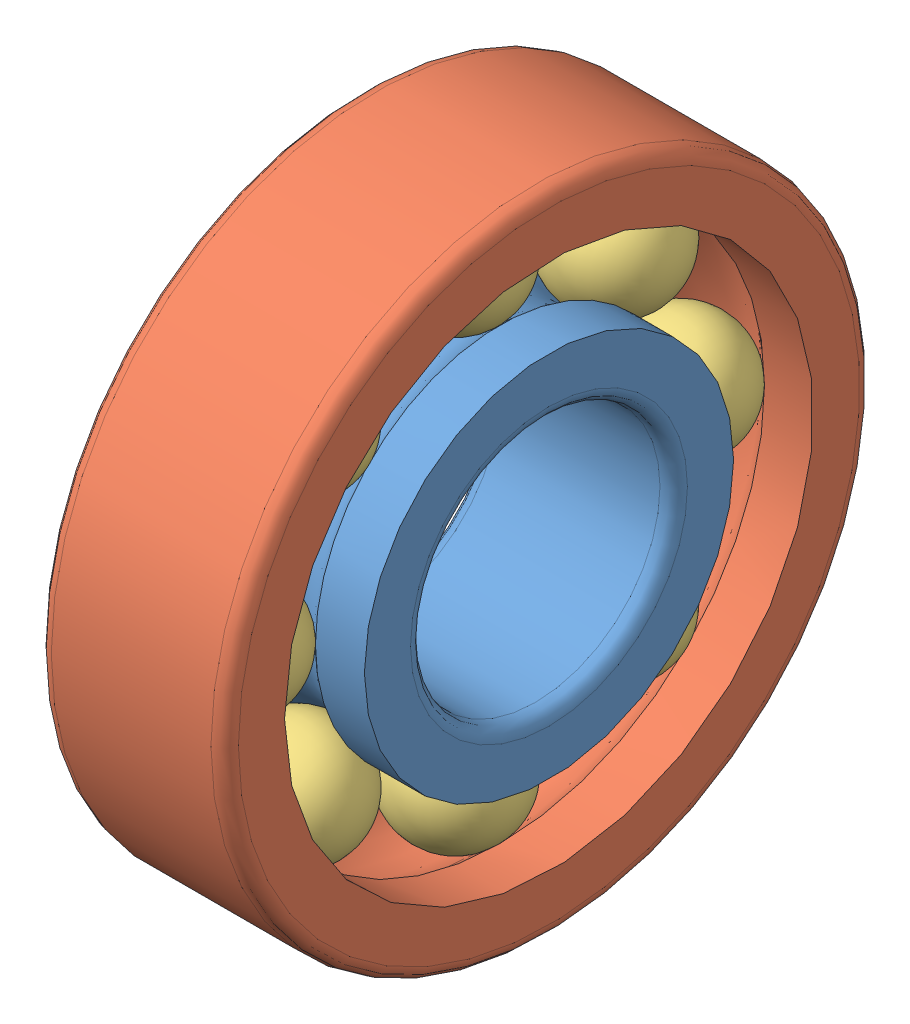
SolidWorks assembly Roulement_r1rb48.SLDASM, configuration Défaut (file format 3100). Lengths in mm.
Overall size (15 52 52).
10 component instances, 3 part files, 4 mates.
Components (placement in the parent):
- Roulement_r1rb_Bint48-1: Roulement_r1rb_Bint48.SLDPRT [Défaut] at origin size (15 29.6 29.6)
- Roulement_r1rb_Bext48-1: Roulement_r1rb_Bext48.SLDPRT [Défaut] at origin size (15 52 52)
- Roulement_r1rb_Eroul48-1: Roulement_r1rb_Eroul48.SLDPRT [Défaut] at (1.1 0 -11.1) size (9.6 9.6 9.6)
- Roulement_r1rb_Eroul48-2: Roulement_r1rb_Eroul48.SLDPRT [Défaut] at (1.1 7.8489 -7.8489) x (1 0 0) z (0 -0.707107 0.707107) size (9.6 9.6 9.6)
- Roulement_r1rb_Eroul48-3: Roulement_r1rb_Eroul48.SLDPRT [Défaut] at (1.1 11.1 0) x (1 0 0) z (0 -1 0) size (9.6 9.6 9.6)
- Roulement_r1rb_Eroul48-4: Roulement_r1rb_Eroul48.SLDPRT [Défaut] at (1.1 7.8489 7.8489) x (1 0 0) z (0 -0.707107 -0.707107) size (9.6 9.6 9.6)
- Roulement_r1rb_Eroul48-5: Roulement_r1rb_Eroul48.SLDPRT [Défaut] at (1.1 0 11.1) x (1 0 0) z (0 0 -1) size (9.6 9.6 9.6)
- Roulement_r1rb_Eroul48-6: Roulement_r1rb_Eroul48.SLDPRT [Défaut] at (1.1 -7.8489 7.8489) x (1 0 0) z (0 0.707107 -0.707107) size (9.6 9.6 9.6)
- Roulement_r1rb_Eroul48-7: Roulement_r1rb_Eroul48.SLDPRT [Défaut] at (1.1 -11.1 0) x (1 0 0) z (0 1 0) size (9.6 9.6 9.6)
- Roulement_r1rb_Eroul48-8: Roulement_r1rb_Eroul48.SLDPRT [Défaut] at (1.1 -7.8489 -7.8489) x (1 0 0) z (0 0.707107 0.707107) size (9.6 9.6 9.6)
Mates (geometry in assembly coordinates):
- Coïncidente1: coincident: point of ?
- Coïncidente2: coincident: unknown of ?
- Coïncidente4: coincident: point of Roulement_r1rb_Eroul48-1; point of assembly
- Parallèle1: parallel = 29.4109 mm aligned: plane of ? through (0 0 0) normal (1 0 0); unknown of ?
